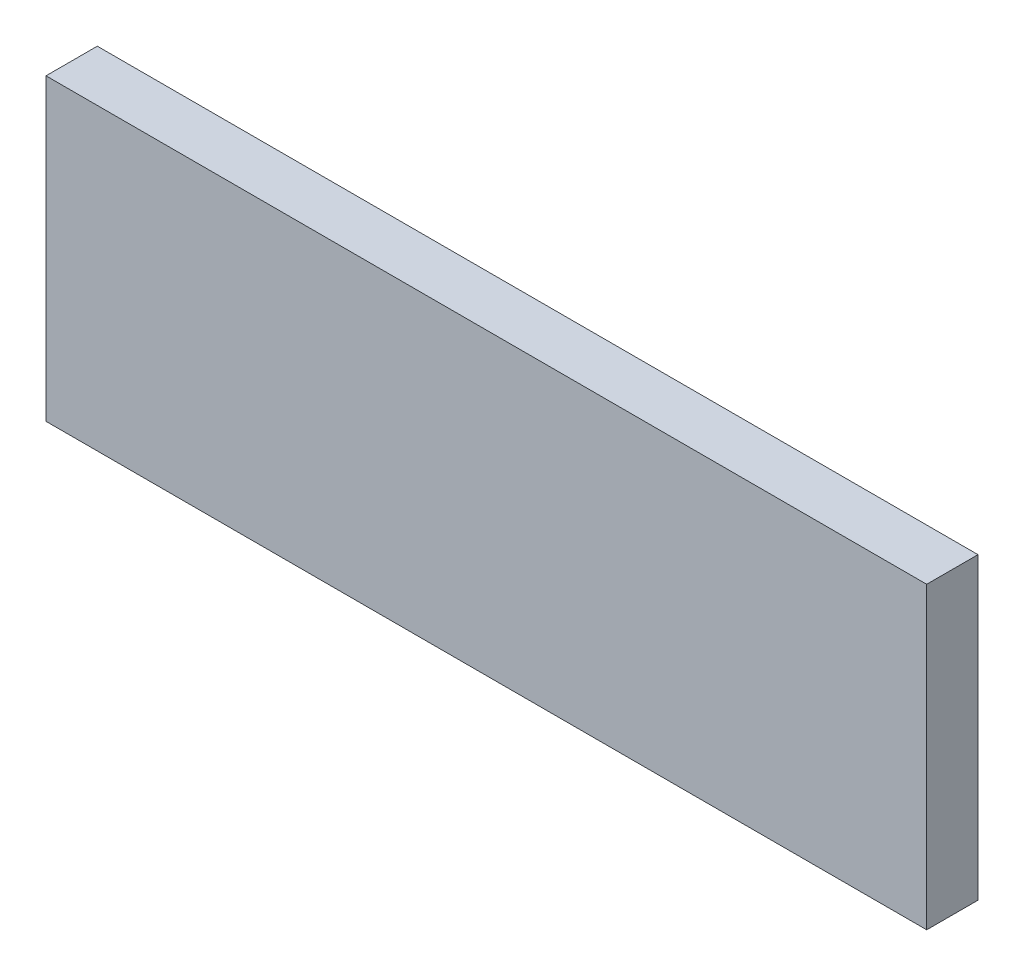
from build123d import *

# Parameters (mm, degrees)
ESQUISSE1_W          = 103
ESQUISSE1_H          = 35
BASE_EXTRUSION_DEPTH = 6


with BuildPart() as part:
    # Esquisse1 → Base-Extrusion (new body)
    with BuildSketch(Plane.XY):
        with Locations((-15.446928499, 4.868882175)):
            Rectangle(ESQUISSE1_W, ESQUISSE1_H)
    extrude(amount=BASE_EXTRUSION_DEPTH)


solid = part.part
